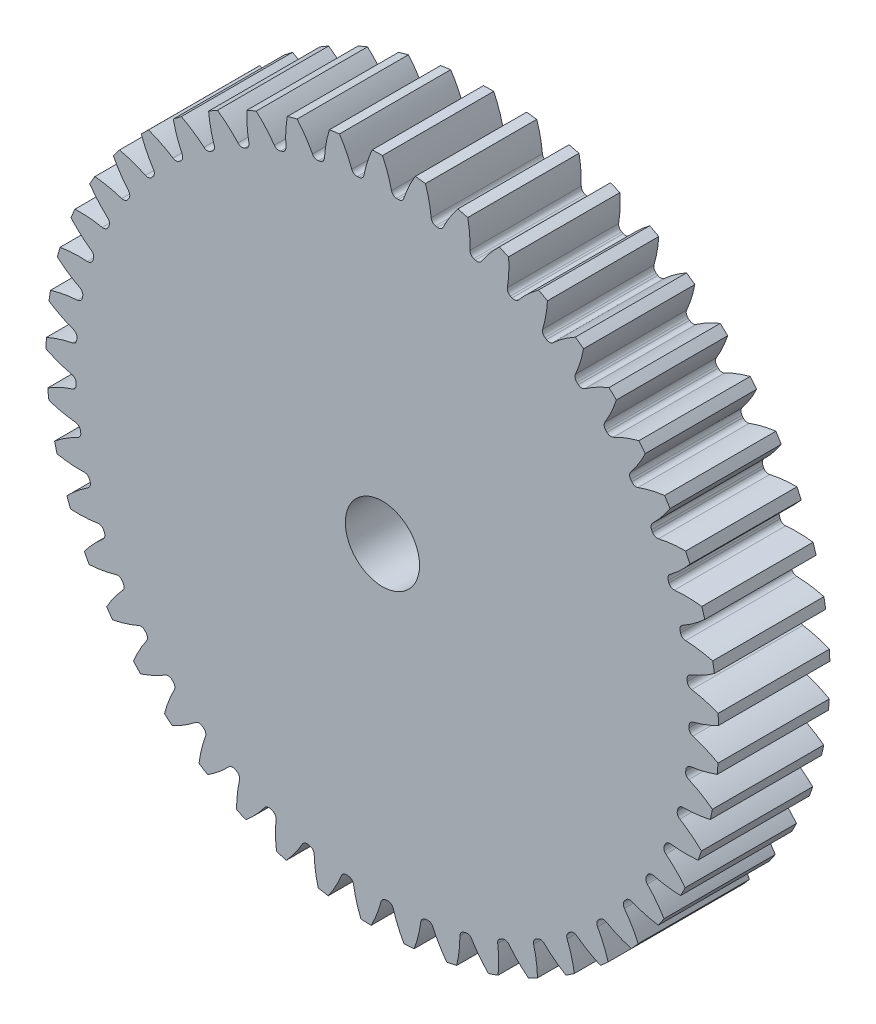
from build123d import *

# Parameters (mm, degrees)
SKETCH3_R         = 287.866666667
GEARBODY_DEPTH    = 95.25
TOOTHCUT_DEPTH    = 419.099268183
CIRPATTERN1_COUNT = 49
BOREDIA_R         = 31.75
BORE_DEPTH        = 12700


with BuildPart() as part:
    # Sketch3 → gearBody (new body)
    with BuildSketch(Plane.XY):
        Circle(SKETCH3_R)
    extrude(amount=GEARBODY_DEPTH)

    # Sketch2 → toothCut (cut, through all)
    with BuildSketch(Plane.XY):
        with BuildLine():
            ThreePointArc((262.414921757, -5.211520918), (262.429444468, -4.420156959), (262.441580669, -3.628752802))
            ThreePointArc((262.441580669, -3.628752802), (263.419217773, -0.858362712), (265.875453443, 0.753388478))
            ThreePointArc((265.875453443, 0.753388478), (277.119432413, 4.395558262), (287.866666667, 9.313832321))
            ThreePointArc((287.866666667, 9.313832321), (287.976454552, -4.850450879), (287.38971998, -19.003002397))
            ThreePointArc((287.38971998, -19.003002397), (276.814214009, -13.725584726), (265.699269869, -9.706818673))
            ThreePointArc((265.699269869, -9.706818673), (263.298706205, -8.013263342), (262.414921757, -5.211520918))
        make_face()
    toothcut = extrude(amount=TOOTHCUT_DEPTH, mode=Mode.SUBTRACT)

    # CirPattern1: toothCut ×49 about axis
    cirpattern1_axis = Axis((0, 0, 0), (0, 0, 1))
    for i in range(1, CIRPATTERN1_COUNT):
        add(toothcut.rotate(cirpattern1_axis, i * 360 / CIRPATTERN1_COUNT), mode=Mode.SUBTRACT)

    # boreDia → bore (cut, symmetric)
    with BuildSketch(Plane.XY):
        Circle(BOREDIA_R)
    extrude(amount=BORE_DEPTH, both=True, mode=Mode.SUBTRACT)


solid = part.part
